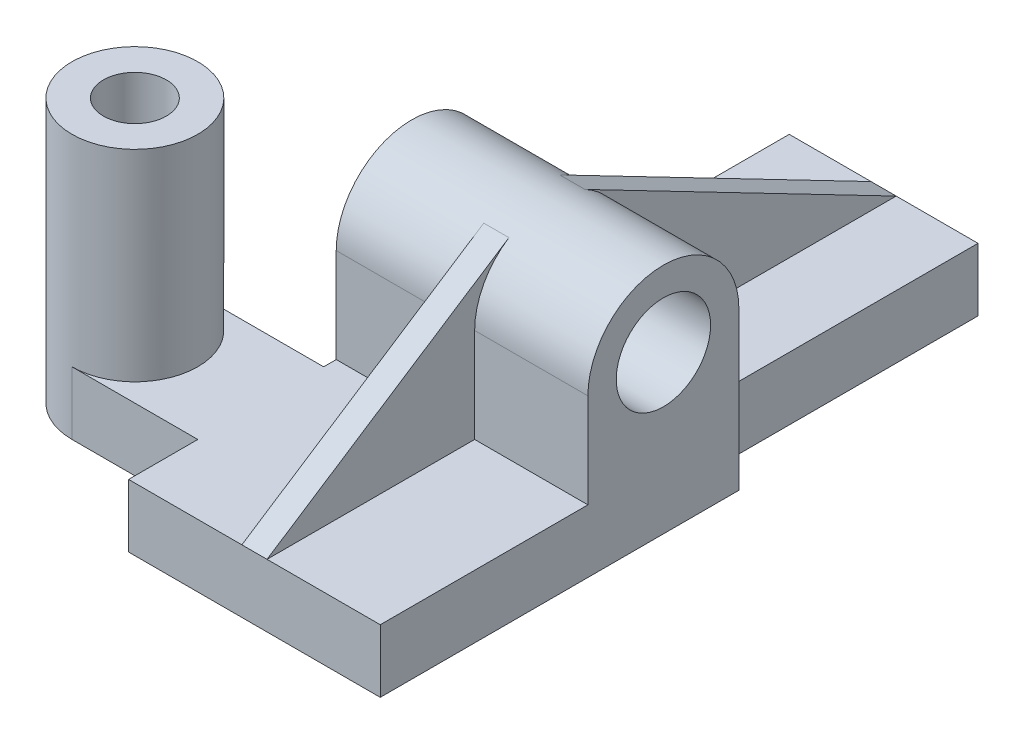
ISO-10303-21;
HEADER;
FILE_DESCRIPTION(('STEP AP214'),'2;1');
FILE_NAME('part.step','',(''),(''),'','','');
FILE_SCHEMA(('AUTOMOTIVE_DESIGN { 1 0 10303 214 1 1 1 1 }'));
ENDSEC;
DATA;
#1=APPLICATION_CONTEXT('core data for automotive mechanical design processes');
#2=APPLICATION_PROTOCOL_DEFINITION('international standard','automotive_design',2000,#1);
#3=PRODUCT_CONTEXT('',#1,'mechanical');
#4=PRODUCT('Part','Part','',(#3));
#5=PRODUCT_RELATED_PRODUCT_CATEGORY('part','',(#4));
#6=PRODUCT_DEFINITION_FORMATION('','',#4);
#7=PRODUCT_DEFINITION_CONTEXT('part definition',#1,'design');
#8=PRODUCT_DEFINITION('design','',#6,#7);
#9=PRODUCT_DEFINITION_SHAPE('','',#8);
#10=(LENGTH_UNIT() NAMED_UNIT(*) SI_UNIT(.MILLI.,.METRE.));
#11=(NAMED_UNIT(*) PLANE_ANGLE_UNIT() SI_UNIT($,.RADIAN.));
#12=(NAMED_UNIT(*) SI_UNIT($,.STERADIAN.) SOLID_ANGLE_UNIT());
#13=UNCERTAINTY_MEASURE_WITH_UNIT(LENGTH_MEASURE(1.E-05),#10,'distance_accuracy_value','');
#14=(GEOMETRIC_REPRESENTATION_CONTEXT(3) GLOBAL_UNCERTAINTY_ASSIGNED_CONTEXT((#13)) GLOBAL_UNIT_ASSIGNED_CONTEXT((#10,
#11,#12)) REPRESENTATION_CONTEXT('',''));
#15=CARTESIAN_POINT('',(0.,0.,0.));
#16=DIRECTION('',(0.,0.,1.));
#17=DIRECTION('',(1.,0.,0.));
#18=AXIS2_PLACEMENT_3D('',#15,#16,#17);
#19=CARTESIAN_POINT('',(20.,10.,0.));
#20=DIRECTION('',(-1.,0.,0.));
#21=DIRECTION('',(0.,0.,1.));
#22=AXIS2_PLACEMENT_3D('',#19,#20,#21);
#23=PLANE('',#22);
#24=DIRECTION('',(0.,0.,-1.));
#25=VECTOR('',#24,1.);
#26=CARTESIAN_POINT('',(20.,0.,0.));
#27=LINE('',#26,#25);
#28=CARTESIAN_POINT('',(20.,0.,0.));
#29=VERTEX_POINT('',#28);
#30=CARTESIAN_POINT('',(20.,0.,-57.));
#31=VERTEX_POINT('',#30);
#32=EDGE_CURVE('E499',#29,#31,#27,.T.);
#33=ORIENTED_EDGE('',*,*,#32,.T.);
#34=DIRECTION('',(0.,-1.,0.));
#35=VECTOR('',#34,1.);
#36=CARTESIAN_POINT('',(20.,10.,-57.));
#37=LINE('',#36,#35);
#38=CARTESIAN_POINT('',(20.,25.,-57.));
#39=VERTEX_POINT('',#38);
#40=EDGE_CURVE('E285',#39,#31,#37,.T.);
#41=ORIENTED_EDGE('',*,*,#40,.F.);
#42=CARTESIAN_POINT('',(20.,25.,-45.));
#43=DIRECTION('',(1.,0.,0.));
#44=DIRECTION('',(0.,0.,1.));
#45=AXIS2_PLACEMENT_3D('',#42,#43,#44);
#46=CIRCLE('',#45,12.);
#47=CARTESIAN_POINT('',(20.,25.,-33.));
#48=VERTEX_POINT('',#47);
#49=EDGE_CURVE('E256',#39,#48,#46,.T.);
#50=ORIENTED_EDGE('',*,*,#49,.T.);
#51=DIRECTION('',(0.,-1.,0.));
#52=VECTOR('',#51,1.);
#53=CARTESIAN_POINT('',(20.,10.,-33.));
#54=LINE('',#53,#52);
#55=CARTESIAN_POINT('',(20.,10.,-33.));
#56=VERTEX_POINT('',#55);
#57=EDGE_CURVE('E253',#48,#56,#54,.T.);
#58=ORIENTED_EDGE('',*,*,#57,.T.);
#59=DIRECTION('',(0.,0.,-1.));
#60=VECTOR('',#59,1.);
#61=CARTESIAN_POINT('',(20.,10.,0.));
#62=LINE('',#61,#60);
#63=CARTESIAN_POINT('',(20.,10.,0.));
#64=VERTEX_POINT('',#63);
#65=EDGE_CURVE('E217',#64,#56,#62,.T.);
#66=ORIENTED_EDGE('',*,*,#65,.F.);
#67=DIRECTION('',(0.,-1.,0.));
#68=VECTOR('',#67,1.);
#69=CARTESIAN_POINT('',(20.,10.,0.));
#70=LINE('',#69,#68);
#71=EDGE_CURVE('E293',#64,#29,#70,.T.);
#72=ORIENTED_EDGE('',*,*,#71,.T.);
#73=EDGE_LOOP('',(#33,#41,#50,#58,#66,#72));
#74=FACE_BOUND('',#73,.T.);
#75=CARTESIAN_POINT('',(20.,25.,-45.));
#76=DIRECTION('',(1.,0.,0.));
#77=DIRECTION('',(0.,0.,-1.));
#78=AXIS2_PLACEMENT_3D('',#75,#76,#77);
#79=CIRCLE('',#78,7.49999999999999);
#80=CARTESIAN_POINT('',(20.,25.,-52.5));
#81=VERTEX_POINT('',#80);
#82=EDGE_CURVE('E522',#81,#81,#79,.T.);
#83=ORIENTED_EDGE('',*,*,#82,.F.);
#84=EDGE_LOOP('',(#83));
#85=FACE_BOUND('',#84,.T.);
#86=ADVANCED_FACE('F32',(#74,#85),#23,.F.);
#87=CARTESIAN_POINT('',(-20.,10.,-57.));
#88=DIRECTION('',(0.,0.,1.));
#89=DIRECTION('',(1.,0.,0.));
#90=AXIS2_PLACEMENT_3D('',#87,#88,#89);
#91=PLANE('',#90);
#92=DIRECTION('',(0.,1.,0.));
#93=VECTOR('',#92,1.);
#94=CARTESIAN_POINT('',(-2.,10.,-57.));
#95=LINE('',#94,#93);
#96=CARTESIAN_POINT('',(-2.,10.,-57.));
#97=VERTEX_POINT('',#96);
#98=CARTESIAN_POINT('',(-2.,25.,-57.));
#99=VERTEX_POINT('',#98);
#100=EDGE_CURVE('E49',#97,#99,#95,.T.);
#101=ORIENTED_EDGE('',*,*,#100,.F.);
#102=DIRECTION('',(1.,0.,0.));
#103=VECTOR('',#102,1.);
#104=CARTESIAN_POINT('',(-20.,10.,-57.));
#105=LINE('',#104,#103);
#106=CARTESIAN_POINT('',(-15.,10.,-57.));
#107=VERTEX_POINT('',#106);
#108=EDGE_CURVE('E207',#107,#97,#105,.T.);
#109=ORIENTED_EDGE('',*,*,#108,.F.);
#110=DIRECTION('',(0.,-1.,0.));
#111=VECTOR('',#110,1.);
#112=CARTESIAN_POINT('',(-15.,10.,-57.));
#113=LINE('',#112,#111);
#114=CARTESIAN_POINT('',(-15.,0.,-57.));
#115=VERTEX_POINT('',#114);
#116=EDGE_CURVE('E237',#107,#115,#113,.T.);
#117=ORIENTED_EDGE('',*,*,#116,.T.);
#118=DIRECTION('',(-1.,0.,0.));
#119=VECTOR('',#118,1.);
#120=CARTESIAN_POINT('',(-20.,0.,-57.));
#121=LINE('',#120,#119);
#122=CARTESIAN_POINT('',(-20.,0.,-57.));
#123=VERTEX_POINT('',#122);
#124=EDGE_CURVE('E315',#115,#123,#121,.T.);
#125=ORIENTED_EDGE('',*,*,#124,.T.);
#126=DIRECTION('',(0.,-1.,0.));
#127=VECTOR('',#126,1.);
#128=CARTESIAN_POINT('',(-20.,10.,-57.));
#129=LINE('',#128,#127);
#130=CARTESIAN_POINT('',(-20.,25.,-57.));
#131=VERTEX_POINT('',#130);
#132=EDGE_CURVE('E240',#131,#123,#129,.T.);
#133=ORIENTED_EDGE('',*,*,#132,.F.);
#134=DIRECTION('',(1.,0.,0.));
#135=VECTOR('',#134,1.);
#136=CARTESIAN_POINT('',(-20.,25.,-57.));
#137=LINE('',#136,#135);
#138=EDGE_CURVE('E311',#131,#99,#137,.T.);
#139=ORIENTED_EDGE('',*,*,#138,.T.);
#140=EDGE_LOOP('',(#101,#109,#117,#125,#133,#139));
#141=FACE_BOUND('',#140,.T.);
#142=ADVANCED_FACE('F447',(#141),#91,.F.);
#143=CARTESIAN_POINT('',(-20.,10.,-57.));
#144=DIRECTION('',(0.,-1.,0.));
#145=DIRECTION('',(0.,0.,-1.));
#146=AXIS2_PLACEMENT_3D('',#143,#144,#145);
#147=PLANE('',#146);
#148=DIRECTION('',(0.,0.,1.));
#149=VECTOR('',#148,1.);
#150=CARTESIAN_POINT('',(-2.,10.,-57.));
#151=LINE('',#150,#149);
#152=CARTESIAN_POINT('',(-2.,10.,-100.));
#153=VERTEX_POINT('',#152);
#154=EDGE_CURVE('E198',#153,#97,#151,.T.);
#155=ORIENTED_EDGE('',*,*,#154,.F.);
#156=DIRECTION('',(-1.,0.,0.));
#157=VECTOR('',#156,1.);
#158=CARTESIAN_POINT('',(-15.,10.,-100.));
#159=LINE('',#158,#157);
#160=CARTESIAN_POINT('',(-15.,10.,-100.));
#161=VERTEX_POINT('',#160);
#162=EDGE_CURVE('E204',#153,#161,#159,.T.);
#163=ORIENTED_EDGE('',*,*,#162,.T.);
#164=DIRECTION('',(0.,0.,1.));
#165=VECTOR('',#164,1.);
#166=CARTESIAN_POINT('',(-15.,10.,-57.));
#167=LINE('',#166,#165);
#168=EDGE_CURVE('E216',#161,#107,#167,.T.);
#169=ORIENTED_EDGE('',*,*,#168,.T.);
#170=ORIENTED_EDGE('',*,*,#108,.T.);
#171=EDGE_LOOP('',(#155,#163,#169,#170));
#172=FACE_BOUND('',#171,.T.);
#173=ADVANCED_FACE('F203',(#172),#147,.F.);
#174=DIRECTION('',(0.,0.,1.));
#175=VECTOR('',#174,1.);
#176=CARTESIAN_POINT('',(-2.,10.,-57.));
#177=LINE('',#176,#175);
#178=CARTESIAN_POINT('',(-2.,10.,-33.));
#179=VERTEX_POINT('',#178);
#180=CARTESIAN_POINT('',(-2.,10.,0.));
#181=VERTEX_POINT('',#180);
#182=EDGE_CURVE('E369',#179,#181,#177,.T.);
#183=ORIENTED_EDGE('',*,*,#182,.F.);
#184=DIRECTION('',(1.,0.,0.));
#185=VECTOR('',#184,1.);
#186=CARTESIAN_POINT('',(-20.,10.,-33.));
#187=LINE('',#186,#185);
#188=CARTESIAN_POINT('',(-20.,10.,-33.));
#189=VERTEX_POINT('',#188);
#190=EDGE_CURVE('E257',#189,#179,#187,.T.);
#191=ORIENTED_EDGE('',*,*,#190,.F.);
#192=DIRECTION('',(0.,0.,1.));
#193=VECTOR('',#192,1.);
#194=CARTESIAN_POINT('',(-20.,10.,0.));
#195=LINE('',#194,#193);
#196=CARTESIAN_POINT('',(-20.,10.,-31.));
#197=VERTEX_POINT('',#196);
#198=EDGE_CURVE('E305',#189,#197,#195,.T.);
#199=ORIENTED_EDGE('',*,*,#198,.T.);
#200=DIRECTION('',(-1.,0.,0.));
#201=VECTOR('',#200,1.);
#202=CARTESIAN_POINT('',(-20.,10.,-31.));
#203=LINE('',#202,#201);
#204=CARTESIAN_POINT('',(-40.,10.,-31.));
#205=VERTEX_POINT('',#204);
#206=EDGE_CURVE('E394',#197,#205,#203,.T.);
#207=ORIENTED_EDGE('',*,*,#206,.T.);
#208=CARTESIAN_POINT('',(-40.,10.,-21.));
#209=DIRECTION('',(0.,-1.,0.));
#210=DIRECTION('',(0.,0.,-1.));
#211=AXIS2_PLACEMENT_3D('',#208,#209,#210);
#212=CIRCLE('',#211,10.);
#213=CARTESIAN_POINT('',(-40.,10.,-11.));
#214=VERTEX_POINT('',#213);
#215=EDGE_CURVE('E344',#214,#205,#212,.F.);
#216=ORIENTED_EDGE('',*,*,#215,.F.);
#217=DIRECTION('',(1.,0.,0.));
#218=VECTOR('',#217,1.);
#219=CARTESIAN_POINT('',(-20.,10.,-11.));
#220=LINE('',#219,#218);
#221=CARTESIAN_POINT('',(-20.,10.,-11.));
#222=VERTEX_POINT('',#221);
#223=EDGE_CURVE('E321',#214,#222,#220,.T.);
#224=ORIENTED_EDGE('',*,*,#223,.T.);
#225=CARTESIAN_POINT('',(-20.,10.,0.));
#226=VERTEX_POINT('',#225);
#227=EDGE_CURVE('E309',#222,#226,#195,.T.);
#228=ORIENTED_EDGE('',*,*,#227,.T.);
#229=DIRECTION('',(1.,0.,0.));
#230=VECTOR('',#229,1.);
#231=CARTESIAN_POINT('',(-20.,10.,0.));
#232=LINE('',#231,#230);
#233=EDGE_CURVE('E312',#226,#181,#232,.T.);
#234=ORIENTED_EDGE('',*,*,#233,.T.);
#235=EDGE_LOOP('',(#183,#191,#199,#207,#216,#224,#228,#234));
#236=FACE_BOUND('',#235,.T.);
#237=ADVANCED_FACE('F392',(#236),#147,.F.);
#238=CARTESIAN_POINT('',(-20.,10.,-33.));
#239=DIRECTION('',(0.,0.,1.));
#240=DIRECTION('',(1.,0.,0.));
#241=AXIS2_PLACEMENT_3D('',#238,#239,#240);
#242=PLANE('',#241);
#243=ORIENTED_EDGE('',*,*,#190,.T.);
#244=DIRECTION('',(0.,1.,0.));
#245=VECTOR('',#244,1.);
#246=CARTESIAN_POINT('',(-2.,10.,-33.));
#247=LINE('',#246,#245);
#248=CARTESIAN_POINT('',(-2.,25.,-33.));
#249=VERTEX_POINT('',#248);
#250=EDGE_CURVE('E366',#179,#249,#247,.T.);
#251=ORIENTED_EDGE('',*,*,#250,.T.);
#252=DIRECTION('',(1.,0.,0.));
#253=VECTOR('',#252,1.);
#254=CARTESIAN_POINT('',(-20.,25.,-33.));
#255=LINE('',#254,#253);
#256=CARTESIAN_POINT('',(-20.,25.,-33.));
#257=VERTEX_POINT('',#256);
#258=EDGE_CURVE('E268',#257,#249,#255,.T.);
#259=ORIENTED_EDGE('',*,*,#258,.F.);
#260=DIRECTION('',(0.,-1.,0.));
#261=VECTOR('',#260,1.);
#262=CARTESIAN_POINT('',(-20.,10.,-33.));
#263=LINE('',#262,#261);
#264=EDGE_CURVE('E246',#257,#189,#263,.T.);
#265=ORIENTED_EDGE('',*,*,#264,.T.);
#266=EDGE_LOOP('',(#243,#251,#259,#265));
#267=FACE_BOUND('',#266,.T.);
#268=ADVANCED_FACE('F471',(#267),#242,.T.);
#269=CARTESIAN_POINT('',(2.,10.,-33.));
#270=VERTEX_POINT('',#269);
#271=EDGE_CURVE('E261',#270,#56,#187,.T.);
#272=ORIENTED_EDGE('',*,*,#271,.F.);
#273=DIRECTION('',(0.,0.,1.));
#274=VECTOR('',#273,1.);
#275=CARTESIAN_POINT('',(2.,10.,-57.));
#276=LINE('',#275,#274);
#277=CARTESIAN_POINT('',(2.,10.,0.));
#278=VERTEX_POINT('',#277);
#279=EDGE_CURVE('E377',#270,#278,#276,.T.);
#280=ORIENTED_EDGE('',*,*,#279,.T.);
#281=EDGE_CURVE('E308',#278,#64,#232,.T.);
#282=ORIENTED_EDGE('',*,*,#281,.T.);
#283=ORIENTED_EDGE('',*,*,#65,.T.);
#284=EDGE_LOOP('',(#272,#280,#282,#283));
#285=FACE_BOUND('',#284,.T.);
#286=ADVANCED_FACE('F422',(#285),#147,.F.);
#287=CARTESIAN_POINT('',(-20.,10.,0.));
#288=DIRECTION('',(1.,0.,0.));
#289=DIRECTION('',(0.,0.,-1.));
#290=AXIS2_PLACEMENT_3D('',#287,#288,#289);
#291=PLANE('',#290);
#292=CARTESIAN_POINT('',(-20.,25.,-45.));
#293=DIRECTION('',(1.,0.,0.));
#294=DIRECTION('',(0.,0.,-1.));
#295=AXIS2_PLACEMENT_3D('',#292,#293,#294);
#296=CIRCLE('',#295,7.49999999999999);
#297=CARTESIAN_POINT('',(-20.,25.,-52.5));
#298=VERTEX_POINT('',#297);
#299=EDGE_CURVE('E477',#298,#298,#296,.T.);
#300=ORIENTED_EDGE('',*,*,#299,.T.);
#301=EDGE_LOOP('',(#300));
#302=FACE_BOUND('',#301,.T.);
#303=DIRECTION('',(0.,-1.,0.));
#304=VECTOR('',#303,1.);
#305=CARTESIAN_POINT('',(-20.,10.,-31.));
#306=LINE('',#305,#304);
#307=CARTESIAN_POINT('',(-20.,0.,-31.));
#308=VERTEX_POINT('',#307);
#309=EDGE_CURVE('E334',#197,#308,#306,.T.);
#310=ORIENTED_EDGE('',*,*,#309,.F.);
#311=ORIENTED_EDGE('',*,*,#198,.F.);
#312=ORIENTED_EDGE('',*,*,#264,.F.);
#313=CARTESIAN_POINT('',(-20.,25.,-45.));
#314=DIRECTION('',(1.,0.,0.));
#315=DIRECTION('',(0.,0.,1.));
#316=AXIS2_PLACEMENT_3D('',#313,#314,#315);
#317=CIRCLE('',#316,12.);
#318=EDGE_CURVE('E250',#131,#257,#317,.T.);
#319=ORIENTED_EDGE('',*,*,#318,.F.);
#320=ORIENTED_EDGE('',*,*,#132,.T.);
#321=DIRECTION('',(0.,0.,1.));
#322=VECTOR('',#321,1.);
#323=CARTESIAN_POINT('',(-20.,0.,0.));
#324=LINE('',#323,#322);
#325=EDGE_CURVE('E232',#123,#308,#324,.T.);
#326=ORIENTED_EDGE('',*,*,#325,.T.);
#327=EDGE_LOOP('',(#310,#311,#312,#319,#320,#326));
#328=FACE_BOUND('',#327,.T.);
#329=ADVANCED_FACE('F463',(#302,#328),#291,.F.);
#330=ORIENTED_EDGE('',*,*,#227,.F.);
#331=DIRECTION('',(0.,-1.,0.));
#332=VECTOR('',#331,1.);
#333=CARTESIAN_POINT('',(-20.,10.,-11.));
#334=LINE('',#333,#332);
#335=CARTESIAN_POINT('',(-20.,0.,-11.));
#336=VERTEX_POINT('',#335);
#337=EDGE_CURVE('E316',#222,#336,#334,.T.);
#338=ORIENTED_EDGE('',*,*,#337,.T.);
#339=CARTESIAN_POINT('',(-20.,0.,0.));
#340=VERTEX_POINT('',#339);
#341=EDGE_CURVE('E229',#336,#340,#324,.T.);
#342=ORIENTED_EDGE('',*,*,#341,.T.);
#343=DIRECTION('',(0.,-1.,0.));
#344=VECTOR('',#343,1.);
#345=CARTESIAN_POINT('',(-20.,10.,0.));
#346=LINE('',#345,#344);
#347=EDGE_CURVE('E275',#226,#340,#346,.T.);
#348=ORIENTED_EDGE('',*,*,#347,.F.);
#349=EDGE_LOOP('',(#330,#338,#342,#348));
#350=FACE_BOUND('',#349,.T.);
#351=ADVANCED_FACE('F34',(#350),#291,.F.);
#352=CARTESIAN_POINT('',(-20.,10.,0.));
#353=DIRECTION('',(0.,0.,-1.));
#354=DIRECTION('',(-1.,0.,0.));
#355=AXIS2_PLACEMENT_3D('',#352,#353,#354);
#356=PLANE('',#355);
#357=ORIENTED_EDGE('',*,*,#281,.F.);
#358=DIRECTION('',(-1.,0.,0.));
#359=VECTOR('',#358,1.);
#360=CARTESIAN_POINT('',(-20.,10.,0.));
#361=LINE('',#360,#359);
#362=EDGE_CURVE('E364',#181,#278,#361,.F.);
#363=ORIENTED_EDGE('',*,*,#362,.F.);
#364=ORIENTED_EDGE('',*,*,#233,.F.);
#365=ORIENTED_EDGE('',*,*,#347,.T.);
#366=DIRECTION('',(1.,0.,0.));
#367=VECTOR('',#366,1.);
#368=CARTESIAN_POINT('',(-20.,0.,0.));
#369=LINE('',#368,#367);
#370=EDGE_CURVE('E225',#340,#29,#369,.T.);
#371=ORIENTED_EDGE('',*,*,#370,.T.);
#372=ORIENTED_EDGE('',*,*,#71,.F.);
#373=EDGE_LOOP('',(#357,#363,#364,#365,#371,#372));
#374=FACE_BOUND('',#373,.T.);
#375=ADVANCED_FACE('F417',(#374),#356,.F.);
#376=CARTESIAN_POINT('',(15.,10.,-57.));
#377=DIRECTION('',(-1.,0.,0.));
#378=DIRECTION('',(0.,0.,1.));
#379=AXIS2_PLACEMENT_3D('',#376,#377,#378);
#380=PLANE('',#379);
#381=DIRECTION('',(0.,0.,-1.));
#382=VECTOR('',#381,1.);
#383=CARTESIAN_POINT('',(15.,0.,-57.));
#384=LINE('',#383,#382);
#385=CARTESIAN_POINT('',(15.,0.,-57.));
#386=VERTEX_POINT('',#385);
#387=CARTESIAN_POINT('',(15.,0.,-100.));
#388=VERTEX_POINT('',#387);
#389=EDGE_CURVE('E501',#386,#388,#384,.T.);
#390=ORIENTED_EDGE('',*,*,#389,.T.);
#391=DIRECTION('',(0.,-1.,0.));
#392=VECTOR('',#391,1.);
#393=CARTESIAN_POINT('',(15.,10.,-100.));
#394=LINE('',#393,#392);
#395=CARTESIAN_POINT('',(15.,10.,-100.));
#396=VERTEX_POINT('',#395);
#397=EDGE_CURVE('E286',#396,#388,#394,.T.);
#398=ORIENTED_EDGE('',*,*,#397,.F.);
#399=DIRECTION('',(0.,0.,-1.));
#400=VECTOR('',#399,1.);
#401=CARTESIAN_POINT('',(15.,10.,-57.));
#402=LINE('',#401,#400);
#403=CARTESIAN_POINT('',(15.,10.,-57.));
#404=VERTEX_POINT('',#403);
#405=EDGE_CURVE('E214',#404,#396,#402,.T.);
#406=ORIENTED_EDGE('',*,*,#405,.F.);
#407=DIRECTION('',(0.,-1.,0.));
#408=VECTOR('',#407,1.);
#409=CARTESIAN_POINT('',(15.,10.,-57.));
#410=LINE('',#409,#408);
#411=EDGE_CURVE('E283',#404,#386,#410,.T.);
#412=ORIENTED_EDGE('',*,*,#411,.T.);
#413=EDGE_LOOP('',(#390,#398,#406,#412));
#414=FACE_BOUND('',#413,.T.);
#415=ADVANCED_FACE('F456',(#414),#380,.F.);
#416=CARTESIAN_POINT('',(-15.,10.,-100.));
#417=DIRECTION('',(0.,0.,1.));
#418=DIRECTION('',(1.,0.,0.));
#419=AXIS2_PLACEMENT_3D('',#416,#417,#418);
#420=PLANE('',#419);
#421=DIRECTION('',(-1.,0.,0.));
#422=VECTOR('',#421,1.);
#423=CARTESIAN_POINT('',(-15.,0.,-100.));
#424=LINE('',#423,#422);
#425=CARTESIAN_POINT('',(-15.,0.,-100.));
#426=VERTEX_POINT('',#425);
#427=EDGE_CURVE('E486',#388,#426,#424,.T.);
#428=ORIENTED_EDGE('',*,*,#427,.T.);
#429=DIRECTION('',(0.,-1.,0.));
#430=VECTOR('',#429,1.);
#431=CARTESIAN_POINT('',(-15.,10.,-100.));
#432=LINE('',#431,#430);
#433=EDGE_CURVE('E211',#161,#426,#432,.T.);
#434=ORIENTED_EDGE('',*,*,#433,.F.);
#435=ORIENTED_EDGE('',*,*,#162,.F.);
#436=DIRECTION('',(1.,0.,0.));
#437=VECTOR('',#436,1.);
#438=CARTESIAN_POINT('',(-20.,10.,-100.));
#439=LINE('',#438,#437);
#440=CARTESIAN_POINT('',(2.,10.,-100.));
#441=VERTEX_POINT('',#440);
#442=EDGE_CURVE('E184',#153,#441,#439,.T.);
#443=ORIENTED_EDGE('',*,*,#442,.T.);
#444=EDGE_CURVE('E213',#396,#441,#159,.T.);
#445=ORIENTED_EDGE('',*,*,#444,.F.);
#446=ORIENTED_EDGE('',*,*,#397,.T.);
#447=EDGE_LOOP('',(#428,#434,#435,#443,#445,#446));
#448=FACE_BOUND('',#447,.T.);
#449=ADVANCED_FACE('F209',(#448),#420,.F.);
#450=CARTESIAN_POINT('',(-15.,10.,-57.));
#451=DIRECTION('',(1.,0.,0.));
#452=DIRECTION('',(0.,0.,-1.));
#453=AXIS2_PLACEMENT_3D('',#450,#451,#452);
#454=PLANE('',#453);
#455=DIRECTION('',(0.,0.,1.));
#456=VECTOR('',#455,1.);
#457=CARTESIAN_POINT('',(-15.,0.,-57.));
#458=LINE('',#457,#456);
#459=EDGE_CURVE('E484',#426,#115,#458,.T.);
#460=ORIENTED_EDGE('',*,*,#459,.T.);
#461=ORIENTED_EDGE('',*,*,#116,.F.);
#462=ORIENTED_EDGE('',*,*,#168,.F.);
#463=ORIENTED_EDGE('',*,*,#433,.T.);
#464=EDGE_LOOP('',(#460,#461,#462,#463));
#465=FACE_BOUND('',#464,.T.);
#466=ADVANCED_FACE('F505',(#465),#454,.F.);
#467=CARTESIAN_POINT('',(2.,10.,-57.));
#468=VERTEX_POINT('',#467);
#469=EDGE_CURVE('E274',#468,#404,#105,.T.);
#470=ORIENTED_EDGE('',*,*,#469,.F.);
#471=DIRECTION('',(0.,1.,0.));
#472=VECTOR('',#471,1.);
#473=CARTESIAN_POINT('',(2.,10.,-57.));
#474=LINE('',#473,#472);
#475=CARTESIAN_POINT('',(2.,25.,-57.));
#476=VERTEX_POINT('',#475);
#477=EDGE_CURVE('E498',#468,#476,#474,.T.);
#478=ORIENTED_EDGE('',*,*,#477,.T.);
#479=EDGE_CURVE('E249',#476,#39,#137,.T.);
#480=ORIENTED_EDGE('',*,*,#479,.T.);
#481=ORIENTED_EDGE('',*,*,#40,.T.);
#482=DIRECTION('',(-1.,0.,0.));
#483=VECTOR('',#482,1.);
#484=CARTESIAN_POINT('',(15.,0.,-57.));
#485=LINE('',#484,#483);
#486=EDGE_CURVE('E500',#31,#386,#485,.T.);
#487=ORIENTED_EDGE('',*,*,#486,.T.);
#488=ORIENTED_EDGE('',*,*,#411,.F.);
#489=EDGE_LOOP('',(#470,#478,#480,#481,#487,#488));
#490=FACE_BOUND('',#489,.T.);
#491=ADVANCED_FACE('F454',(#490),#91,.F.);
#492=ORIENTED_EDGE('',*,*,#444,.T.);
#493=DIRECTION('',(0.,0.,1.));
#494=VECTOR('',#493,1.);
#495=CARTESIAN_POINT('',(2.,10.,-57.));
#496=LINE('',#495,#494);
#497=EDGE_CURVE('E194',#441,#468,#496,.T.);
#498=ORIENTED_EDGE('',*,*,#497,.T.);
#499=ORIENTED_EDGE('',*,*,#469,.T.);
#500=ORIENTED_EDGE('',*,*,#405,.T.);
#501=EDGE_LOOP('',(#492,#498,#499,#500));
#502=FACE_BOUND('',#501,.T.);
#503=ADVANCED_FACE('F473',(#502),#147,.F.);
#504=CARTESIAN_POINT('',(-20.,0.,-57.));
#505=DIRECTION('',(0.,-1.,0.));
#506=DIRECTION('',(0.,0.,-1.));
#507=AXIS2_PLACEMENT_3D('',#504,#505,#506);
#508=PLANE('',#507);
#509=CARTESIAN_POINT('',(-40.,0.,-21.));
#510=DIRECTION('',(0.,-1.,0.));
#511=DIRECTION('',(0.,0.,-1.));
#512=AXIS2_PLACEMENT_3D('',#509,#510,#511);
#513=CIRCLE('',#512,4.99999999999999);
#514=CARTESIAN_POINT('',(-40.,0.,-26.));
#515=VERTEX_POINT('',#514);
#516=EDGE_CURVE('E36',#515,#515,#513,.T.);
#517=ORIENTED_EDGE('',*,*,#516,.F.);
#518=EDGE_LOOP('',(#517));
#519=FACE_BOUND('',#518,.T.);
#520=ORIENTED_EDGE('',*,*,#32,.F.);
#521=ORIENTED_EDGE('',*,*,#370,.F.);
#522=ORIENTED_EDGE('',*,*,#341,.F.);
#523=DIRECTION('',(1.,0.,0.));
#524=VECTOR('',#523,1.);
#525=CARTESIAN_POINT('',(-20.,0.,-11.));
#526=LINE('',#525,#524);
#527=CARTESIAN_POINT('',(-40.,0.,-11.));
#528=VERTEX_POINT('',#527);
#529=EDGE_CURVE('E322',#528,#336,#526,.T.);
#530=ORIENTED_EDGE('',*,*,#529,.F.);
#531=CARTESIAN_POINT('',(-40.,0.,-21.));
#532=DIRECTION('',(0.,1.,0.));
#533=DIRECTION('',(0.,0.,1.));
#534=AXIS2_PLACEMENT_3D('',#531,#532,#533);
#535=CIRCLE('',#534,10.);
#536=CARTESIAN_POINT('',(-40.,0.,-31.));
#537=VERTEX_POINT('',#536);
#538=EDGE_CURVE('E327',#537,#528,#535,.T.);
#539=ORIENTED_EDGE('',*,*,#538,.F.);
#540=DIRECTION('',(-1.,0.,0.));
#541=VECTOR('',#540,1.);
#542=CARTESIAN_POINT('',(-20.,0.,-31.));
#543=LINE('',#542,#541);
#544=EDGE_CURVE('E342',#308,#537,#543,.T.);
#545=ORIENTED_EDGE('',*,*,#544,.F.);
#546=ORIENTED_EDGE('',*,*,#325,.F.);
#547=ORIENTED_EDGE('',*,*,#124,.F.);
#548=ORIENTED_EDGE('',*,*,#459,.F.);
#549=ORIENTED_EDGE('',*,*,#427,.F.);
#550=ORIENTED_EDGE('',*,*,#389,.F.);
#551=ORIENTED_EDGE('',*,*,#486,.F.);
#552=EDGE_LOOP('',(#520,#521,#522,#530,#539,#545,#546,#547,#548,#549,#550,#551));
#553=FACE_BOUND('',#552,.T.);
#554=ADVANCED_FACE('F408',(#519,#553),#508,.T.);
#555=DIRECTION('',(0.,1.,0.));
#556=VECTOR('',#555,1.);
#557=CARTESIAN_POINT('',(2.,10.,-33.));
#558=LINE('',#557,#556);
#559=CARTESIAN_POINT('',(2.,25.,-33.));
#560=VERTEX_POINT('',#559);
#561=EDGE_CURVE('E375',#270,#560,#558,.T.);
#562=ORIENTED_EDGE('',*,*,#561,.F.);
#563=ORIENTED_EDGE('',*,*,#271,.T.);
#564=ORIENTED_EDGE('',*,*,#57,.F.);
#565=EDGE_CURVE('E433',#560,#48,#255,.T.);
#566=ORIENTED_EDGE('',*,*,#565,.F.);
#567=EDGE_LOOP('',(#562,#563,#564,#566));
#568=FACE_BOUND('',#567,.T.);
#569=ADVANCED_FACE('F432',(#568),#242,.T.);
#570=CARTESIAN_POINT('',(-20.,25.,-45.));
#571=DIRECTION('',(1.,0.,0.));
#572=DIRECTION('',(0.,0.,-1.));
#573=AXIS2_PLACEMENT_3D('',#570,#571,#572);
#574=CYLINDRICAL_SURFACE('',#573,12.);
#575=CARTESIAN_POINT('',(2.,25.,-45.));
#576=DIRECTION('',(1.,0.,0.));
#577=DIRECTION('',(0.,0.,-1.));
#578=AXIS2_PLACEMENT_3D('',#575,#576,#577);
#579=CIRCLE('',#578,12.);
#580=CARTESIAN_POINT('',(2.,35.6531659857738,-50.5235907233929));
#581=VERTEX_POINT('',#580);
#582=EDGE_CURVE('E508',#581,#476,#579,.F.);
#583=ORIENTED_EDGE('',*,*,#582,.F.);
#584=DIRECTION('',(1.,0.,0.));
#585=VECTOR('',#584,1.);
#586=CARTESIAN_POINT('',(-20.,35.6531659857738,-50.5235907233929));
#587=LINE('',#586,#585);
#588=CARTESIAN_POINT('',(-2.,35.6531659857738,-50.5235907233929));
#589=VERTEX_POINT('',#588);
#590=EDGE_CURVE('E11',#581,#589,#587,.F.);
#591=ORIENTED_EDGE('',*,*,#590,.T.);
#592=CARTESIAN_POINT('',(-2.,25.,-45.));
#593=DIRECTION('',(1.,0.,0.));
#594=DIRECTION('',(0.,0.,-1.));
#595=AXIS2_PLACEMENT_3D('',#592,#593,#594);
#596=CIRCLE('',#595,12.);
#597=EDGE_CURVE('E199',#589,#99,#596,.F.);
#598=ORIENTED_EDGE('',*,*,#597,.T.);
#599=ORIENTED_EDGE('',*,*,#138,.F.);
#600=ORIENTED_EDGE('',*,*,#318,.T.);
#601=ORIENTED_EDGE('',*,*,#258,.T.);
#602=CARTESIAN_POINT('',(-2.,25.,-45.));
#603=DIRECTION('',(1.,0.,0.));
#604=DIRECTION('',(0.,0.,-1.));
#605=AXIS2_PLACEMENT_3D('',#602,#603,#604);
#606=CIRCLE('',#605,12.);
#607=CARTESIAN_POINT('',(-2.,35.0538821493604,-38.4487059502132));
#608=VERTEX_POINT('',#607);
#609=EDGE_CURVE('E347',#249,#608,#606,.F.);
#610=ORIENTED_EDGE('',*,*,#609,.T.);
#611=DIRECTION('',(1.,0.,0.));
#612=VECTOR('',#611,1.);
#613=CARTESIAN_POINT('',(-20.,35.0538821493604,-38.4487059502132));
#614=LINE('',#613,#612);
#615=CARTESIAN_POINT('',(2.,35.0538821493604,-38.4487059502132));
#616=VERTEX_POINT('',#615);
#617=EDGE_CURVE('E41',#608,#616,#614,.T.);
#618=ORIENTED_EDGE('',*,*,#617,.T.);
#619=CARTESIAN_POINT('',(2.,25.,-45.));
#620=DIRECTION('',(1.,0.,0.));
#621=DIRECTION('',(0.,0.,-1.));
#622=AXIS2_PLACEMENT_3D('',#619,#620,#621);
#623=CIRCLE('',#622,12.);
#624=EDGE_CURVE('E349',#560,#616,#623,.F.);
#625=ORIENTED_EDGE('',*,*,#624,.F.);
#626=ORIENTED_EDGE('',*,*,#565,.T.);
#627=ORIENTED_EDGE('',*,*,#49,.F.);
#628=ORIENTED_EDGE('',*,*,#479,.F.);
#629=EDGE_LOOP('',(#583,#591,#598,#599,#600,#601,#610,#618,#625,#626,#627,#628));
#630=FACE_BOUND('',#629,.T.);
#631=ADVANCED_FACE('F357',(#630),#574,.T.);
#632=CARTESIAN_POINT('',(-20.,10.,-31.));
#633=DIRECTION('',(0.,0.,1.));
#634=DIRECTION('',(1.,0.,0.));
#635=AXIS2_PLACEMENT_3D('',#632,#633,#634);
#636=PLANE('',#635);
#637=ORIENTED_EDGE('',*,*,#544,.T.);
#638=DIRECTION('',(0.,-1.,0.));
#639=VECTOR('',#638,1.);
#640=CARTESIAN_POINT('',(-40.,10.,-31.));
#641=LINE('',#640,#639);
#642=EDGE_CURVE('E331',#205,#537,#641,.T.);
#643=ORIENTED_EDGE('',*,*,#642,.F.);
#644=ORIENTED_EDGE('',*,*,#206,.F.);
#645=ORIENTED_EDGE('',*,*,#309,.T.);
#646=EDGE_LOOP('',(#637,#643,#644,#645));
#647=FACE_BOUND('',#646,.T.);
#648=ADVANCED_FACE('F481',(#647),#636,.F.);
#649=CARTESIAN_POINT('',(-40.,10.,-21.));
#650=DIRECTION('',(0.,-1.,0.));
#651=DIRECTION('',(0.,0.,-1.));
#652=AXIS2_PLACEMENT_3D('',#649,#650,#651);
#653=CYLINDRICAL_SURFACE('',#652,10.);
#654=ORIENTED_EDGE('',*,*,#538,.T.);
#655=DIRECTION('',(0.,-1.,0.));
#656=VECTOR('',#655,1.);
#657=CARTESIAN_POINT('',(-40.,10.,-11.));
#658=LINE('',#657,#656);
#659=EDGE_CURVE('E320',#214,#528,#658,.T.);
#660=ORIENTED_EDGE('',*,*,#659,.F.);
#661=ORIENTED_EDGE('',*,*,#215,.T.);
#662=ORIENTED_EDGE('',*,*,#642,.T.);
#663=EDGE_LOOP('',(#654,#660,#661,#662));
#664=FACE_BOUND('',#663,.T.);
#665=CARTESIAN_POINT('',(-40.,42.,-21.));
#666=DIRECTION('',(0.,1.,0.));
#667=DIRECTION('',(0.,0.,1.));
#668=AXIS2_PLACEMENT_3D('',#665,#666,#667);
#669=CIRCLE('',#668,10.);
#670=CARTESIAN_POINT('',(-40.,42.,-11.));
#671=VERTEX_POINT('',#670);
#672=EDGE_CURVE('E380',#671,#671,#669,.T.);
#673=ORIENTED_EDGE('',*,*,#672,.F.);
#674=EDGE_LOOP('',(#673));
#675=FACE_BOUND('',#674,.T.);
#676=ADVANCED_FACE('F385',(#664,#675),#653,.T.);
#677=CARTESIAN_POINT('',(-20.,10.,-11.));
#678=DIRECTION('',(0.,0.,-1.));
#679=DIRECTION('',(-1.,0.,0.));
#680=AXIS2_PLACEMENT_3D('',#677,#678,#679);
#681=PLANE('',#680);
#682=ORIENTED_EDGE('',*,*,#529,.T.);
#683=ORIENTED_EDGE('',*,*,#337,.F.);
#684=ORIENTED_EDGE('',*,*,#223,.F.);
#685=ORIENTED_EDGE('',*,*,#659,.T.);
#686=EDGE_LOOP('',(#682,#683,#684,#685));
#687=FACE_BOUND('',#686,.T.);
#688=ADVANCED_FACE('F405',(#687),#681,.F.);
#689=CARTESIAN_POINT('',(-40.,42.,-21.));
#690=DIRECTION('',(0.,1.,0.));
#691=DIRECTION('',(0.,0.,1.));
#692=AXIS2_PLACEMENT_3D('',#689,#690,#691);
#693=PLANE('',#692);
#694=CARTESIAN_POINT('',(-40.,42.,-21.));
#695=DIRECTION('',(0.,1.,0.));
#696=DIRECTION('',(0.,0.,1.));
#697=AXIS2_PLACEMENT_3D('',#694,#695,#696);
#698=CIRCLE('',#697,4.99999999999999);
#699=CARTESIAN_POINT('',(-40.,42.,-16.));
#700=VERTEX_POINT('',#699);
#701=EDGE_CURVE('E518',#700,#700,#698,.T.);
#702=ORIENTED_EDGE('',*,*,#701,.F.);
#703=EDGE_LOOP('',(#702));
#704=FACE_BOUND('',#703,.T.);
#705=ORIENTED_EDGE('',*,*,#672,.T.);
#706=EDGE_LOOP('',(#705));
#707=FACE_BOUND('',#706,.T.);
#708=ADVANCED_FACE('F443',(#704,#707),#693,.T.);
#709=CARTESIAN_POINT('',(0.,10.,0.));
#710=DIRECTION('',(0.,-0.837823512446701,-0.545941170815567));
#711=DIRECTION('',(0.,0.545941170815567,-0.837823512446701));
#712=AXIS2_PLACEMENT_3D('',#709,#710,#711);
#713=PLANE('',#712);
#714=DIRECTION('',(0.,0.545941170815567,-0.837823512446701));
#715=VECTOR('',#714,1.);
#716=CARTESIAN_POINT('',(-2.,10.,0.));
#717=LINE('',#716,#715);
#718=EDGE_CURVE('E57',#181,#608,#717,.T.);
#719=ORIENTED_EDGE('',*,*,#718,.F.);
#720=ORIENTED_EDGE('',*,*,#362,.T.);
#721=DIRECTION('',(0.,0.545941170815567,-0.837823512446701));
#722=VECTOR('',#721,1.);
#723=CARTESIAN_POINT('',(2.,10.,0.));
#724=LINE('',#723,#722);
#725=EDGE_CURVE('E363',#278,#616,#724,.T.);
#726=ORIENTED_EDGE('',*,*,#725,.T.);
#727=ORIENTED_EDGE('',*,*,#617,.F.);
#728=EDGE_LOOP('',(#719,#720,#726,#727));
#729=FACE_BOUND('',#728,.T.);
#730=ADVANCED_FACE('F361',(#729),#713,.F.);
#731=CARTESIAN_POINT('',(2.,20.999975,-50.));
#732=DIRECTION('',(1.,0.,0.));
#733=DIRECTION('',(0.,0.,-1.));
#734=AXIS2_PLACEMENT_3D('',#731,#732,#733);
#735=PLANE('',#734);
#736=ORIENTED_EDGE('',*,*,#279,.F.);
#737=ORIENTED_EDGE('',*,*,#561,.T.);
#738=ORIENTED_EDGE('',*,*,#624,.T.);
#739=ORIENTED_EDGE('',*,*,#725,.F.);
#740=EDGE_LOOP('',(#736,#737,#738,#739));
#741=FACE_BOUND('',#740,.T.);
#742=ADVANCED_FACE('F434',(#741),#735,.T.);
#743=CARTESIAN_POINT('',(-2.,20.999975,-50.));
#744=DIRECTION('',(1.,0.,0.));
#745=DIRECTION('',(0.,0.,-1.));
#746=AXIS2_PLACEMENT_3D('',#743,#744,#745);
#747=PLANE('',#746);
#748=ORIENTED_EDGE('',*,*,#250,.F.);
#749=ORIENTED_EDGE('',*,*,#182,.T.);
#750=ORIENTED_EDGE('',*,*,#718,.T.);
#751=ORIENTED_EDGE('',*,*,#609,.F.);
#752=EDGE_LOOP('',(#748,#749,#750,#751));
#753=FACE_BOUND('',#752,.T.);
#754=ADVANCED_FACE('F436',(#753),#747,.F.);
#755=CARTESIAN_POINT('',(0.,10.,-100.));
#756=DIRECTION('',(0.,0.887763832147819,-0.460299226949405));
#757=DIRECTION('',(0.,0.460299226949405,0.887763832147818));
#758=AXIS2_PLACEMENT_3D('',#755,#756,#757);
#759=PLANE('',#758);
#760=ORIENTED_EDGE('',*,*,#442,.F.);
#761=DIRECTION('',(0.,0.460299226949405,0.887763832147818));
#762=VECTOR('',#761,1.);
#763=CARTESIAN_POINT('',(-2.,10.,-100.));
#764=LINE('',#763,#762);
#765=EDGE_CURVE('E187',#153,#589,#764,.T.);
#766=ORIENTED_EDGE('',*,*,#765,.T.);
#767=ORIENTED_EDGE('',*,*,#590,.F.);
#768=DIRECTION('',(0.,0.460299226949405,0.887763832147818));
#769=VECTOR('',#768,1.);
#770=CARTESIAN_POINT('',(2.,10.,-100.));
#771=LINE('',#770,#769);
#772=EDGE_CURVE('E189',#441,#581,#771,.T.);
#773=ORIENTED_EDGE('',*,*,#772,.F.);
#774=EDGE_LOOP('',(#760,#766,#767,#773));
#775=FACE_BOUND('',#774,.T.);
#776=ADVANCED_FACE('F186',(#775),#759,.T.);
#777=CARTESIAN_POINT('',(2.,20.999975,-50.));
#778=DIRECTION('',(1.,0.,0.));
#779=DIRECTION('',(0.,0.,-1.));
#780=AXIS2_PLACEMENT_3D('',#777,#778,#779);
#781=PLANE('',#780);
#782=ORIENTED_EDGE('',*,*,#497,.F.);
#783=ORIENTED_EDGE('',*,*,#772,.T.);
#784=ORIENTED_EDGE('',*,*,#582,.T.);
#785=ORIENTED_EDGE('',*,*,#477,.F.);
#786=EDGE_LOOP('',(#782,#783,#784,#785));
#787=FACE_BOUND('',#786,.T.);
#788=ADVANCED_FACE('F515',(#787),#781,.T.);
#789=CARTESIAN_POINT('',(-2.,20.999975,-50.));
#790=DIRECTION('',(1.,0.,0.));
#791=DIRECTION('',(0.,0.,-1.));
#792=AXIS2_PLACEMENT_3D('',#789,#790,#791);
#793=PLANE('',#792);
#794=ORIENTED_EDGE('',*,*,#597,.F.);
#795=ORIENTED_EDGE('',*,*,#765,.F.);
#796=ORIENTED_EDGE('',*,*,#154,.T.);
#797=ORIENTED_EDGE('',*,*,#100,.T.);
#798=EDGE_LOOP('',(#794,#795,#796,#797));
#799=FACE_BOUND('',#798,.T.);
#800=ADVANCED_FACE('F197',(#799),#793,.F.);
#801=CARTESIAN_POINT('',(-40.,42.,-21.));
#802=DIRECTION('',(0.,1.,0.));
#803=DIRECTION('',(0.,0.,1.));
#804=AXIS2_PLACEMENT_3D('',#801,#802,#803);
#805=CYLINDRICAL_SURFACE('',#804,4.99999999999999);
#806=ORIENTED_EDGE('',*,*,#516,.T.);
#807=EDGE_LOOP('',(#806));
#808=FACE_BOUND('',#807,.T.);
#809=ORIENTED_EDGE('',*,*,#701,.T.);
#810=EDGE_LOOP('',(#809));
#811=FACE_BOUND('',#810,.T.);
#812=ADVANCED_FACE('F529',(#808,#811),#805,.F.);
#813=CARTESIAN_POINT('',(20.,25.,-45.));
#814=DIRECTION('',(1.,0.,0.));
#815=DIRECTION('',(0.,0.,-1.));
#816=AXIS2_PLACEMENT_3D('',#813,#814,#815);
#817=CYLINDRICAL_SURFACE('',#816,7.49999999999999);
#818=ORIENTED_EDGE('',*,*,#82,.T.);
#819=EDGE_LOOP('',(#818));
#820=FACE_BOUND('',#819,.T.);
#821=ORIENTED_EDGE('',*,*,#299,.F.);
#822=EDGE_LOOP('',(#821));
#823=FACE_BOUND('',#822,.T.);
#824=ADVANCED_FACE('F526',(#820,#823),#817,.F.);
#825=CLOSED_SHELL('',(#86,#142,#173,#237,#268,#286,#329,#351,#375,#415,#449,#466,#491,#503,#554,
#569,#631,#648,#676,#688,#708,#730,#742,#754,#776,#788,#800,#812,#824));
#826=MANIFOLD_SOLID_BREP('B2',#825);
#827=ADVANCED_BREP_SHAPE_REPRESENTATION('',(#18,#826),#14);
#828=SHAPE_DEFINITION_REPRESENTATION(#9,#827);
ENDSEC;
END-ISO-10303-21;
